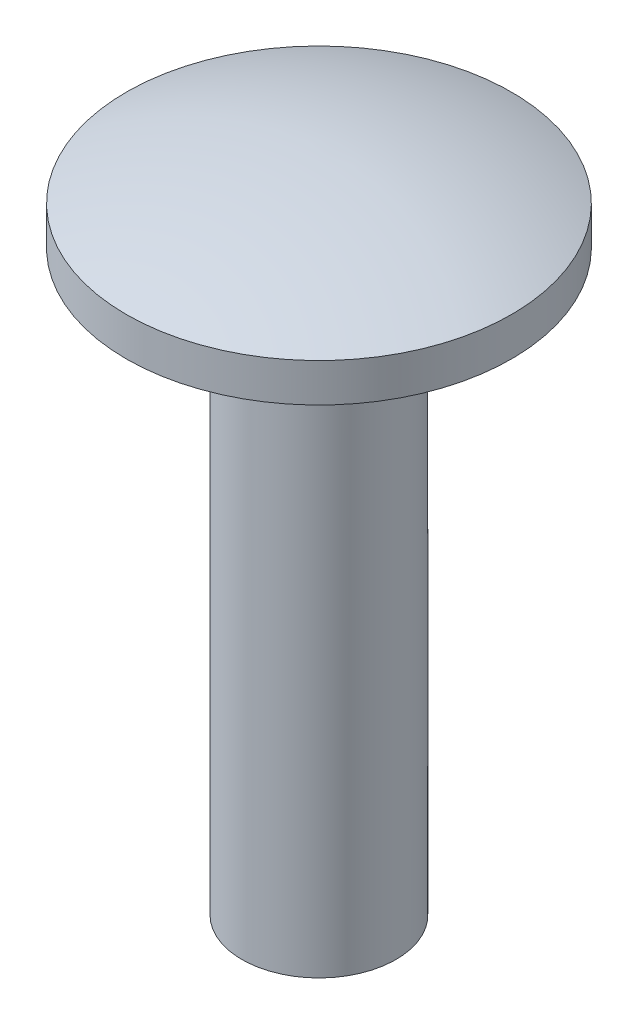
from build123d import *

# Parameters (mm, degrees)
SCHIZZO1_R                    = 5
ESTRUSIONE1_DEPTH             = 1
CUPOLA1_FACE_RADIUS           = 5
CUPOLA1_HEIGHT                = 1
SCHIZZO2_R                    = 2
ESTRUSIONE2_DEPTH             = 15
TAGLIO_ESTRUSIONE1_DEPTH      = 17.583123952
TAGLIO_ESTRUSIONE1_DEPTH_BACK = 17.583123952
SCHIZZO3_R                    = 0.75


with BuildPart() as part:
    # Schizzo1 → Estrusione1 (new body)
    with BuildSketch(Plane(origin=(0, 0, 0), x_dir=(1, 0, 0), z_dir=(0, 1, 0))):
        with Locations(Location((0, 0, 0), (0, 0, 270))):
            Circle(SCHIZZO1_R)
    extrude(amount=ESTRUSIONE1_DEPTH)

    # Cupola1: a dome of height H over a round flat face of radius A is a cap of a sphere of radius (A * A + H * H) / (2 * H)
    cupola1_r = (CUPOLA1_FACE_RADIUS * CUPOLA1_FACE_RADIUS + CUPOLA1_HEIGHT * CUPOLA1_HEIGHT) / (2 * CUPOLA1_HEIGHT)
    cupola1_base = Plane((0, 1, 0), z_dir=(0, 1, 0))
    with Locations(cupola1_base.offset(CUPOLA1_HEIGHT - cupola1_r)):
        cupola1_ball = Sphere(cupola1_r, mode=Mode.PRIVATE)
    add(split(cupola1_ball, bisect_by=cupola1_base, keep=Keep.TOP, mode=Mode.PRIVATE))

    # Schizzo2 → Estrusione2 (add)
    with BuildSketch(Plane.XZ):
        with Locations(Location((0, 0, 0), (0, 0, 90))):
            Circle(SCHIZZO2_R)
    extrude(amount=ESTRUSIONE2_DEPTH)

    # Schizzo3 → Taglio-Estrusione1 (cut, two sides: drawn at the far end of the back side and taken through both)
    with BuildSketch(Plane.XY.offset(-TAGLIO_ESTRUSIONE1_DEPTH_BACK)):
        with Locations(Location((0, -0.75, 0), (0, 0, 90))):
            Circle(SCHIZZO3_R)
    extrude(amount=TAGLIO_ESTRUSIONE1_DEPTH + TAGLIO_ESTRUSIONE1_DEPTH_BACK, mode=Mode.SUBTRACT)


solid = part.part
